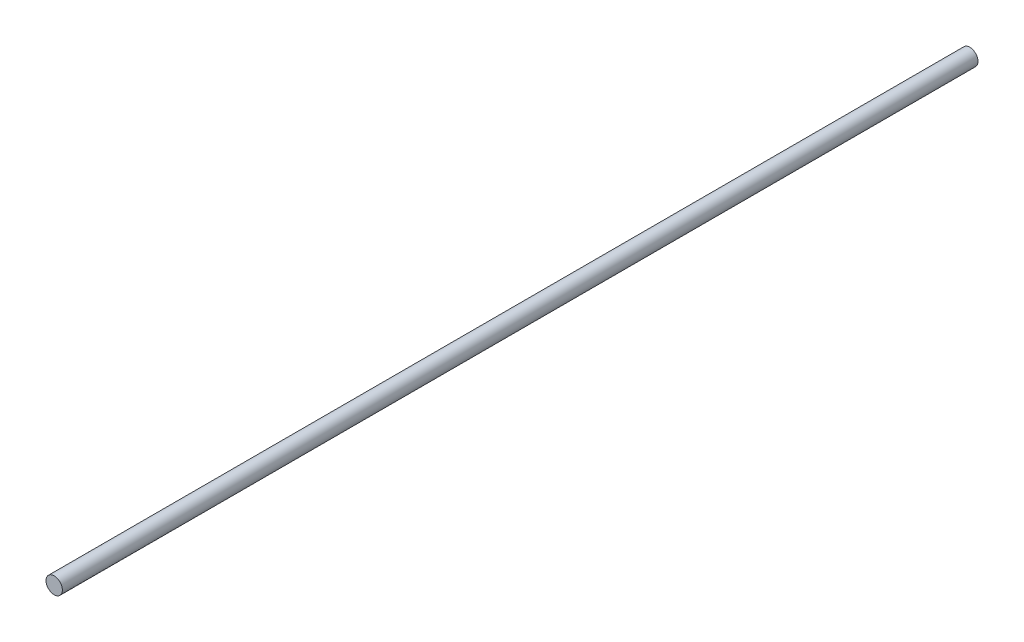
ISO-10303-21;
HEADER;
FILE_DESCRIPTION(('STEP AP214'),'2;1');
FILE_NAME('part.step','',(''),(''),'','','');
FILE_SCHEMA(('AUTOMOTIVE_DESIGN { 1 0 10303 214 1 1 1 1 }'));
ENDSEC;
DATA;
#1=APPLICATION_CONTEXT('core data for automotive mechanical design processes');
#2=APPLICATION_PROTOCOL_DEFINITION('international standard','automotive_design',2000,#1);
#3=PRODUCT_CONTEXT('',#1,'mechanical');
#4=PRODUCT('Part','Part','',(#3));
#5=PRODUCT_RELATED_PRODUCT_CATEGORY('part','',(#4));
#6=PRODUCT_DEFINITION_FORMATION('','',#4);
#7=PRODUCT_DEFINITION_CONTEXT('part definition',#1,'design');
#8=PRODUCT_DEFINITION('design','',#6,#7);
#9=PRODUCT_DEFINITION_SHAPE('','',#8);
#10=(LENGTH_UNIT() NAMED_UNIT(*) SI_UNIT(.MILLI.,.METRE.));
#11=(NAMED_UNIT(*) PLANE_ANGLE_UNIT() SI_UNIT($,.RADIAN.));
#12=(NAMED_UNIT(*) SI_UNIT($,.STERADIAN.) SOLID_ANGLE_UNIT());
#13=UNCERTAINTY_MEASURE_WITH_UNIT(LENGTH_MEASURE(1.E-05),#10,'distance_accuracy_value','');
#14=(GEOMETRIC_REPRESENTATION_CONTEXT(3) GLOBAL_UNCERTAINTY_ASSIGNED_CONTEXT((#13)) GLOBAL_UNIT_ASSIGNED_CONTEXT((#10,
#11,#12)) REPRESENTATION_CONTEXT('',''));
#15=CARTESIAN_POINT('',(0.,0.,0.));
#16=DIRECTION('',(0.,0.,1.));
#17=DIRECTION('',(1.,0.,0.));
#18=AXIS2_PLACEMENT_3D('',#15,#16,#17);
#19=CARTESIAN_POINT('',(0.,0.,-3350.));
#20=DIRECTION('',(0.,0.,1.));
#21=DIRECTION('',(1.,0.,0.));
#22=AXIS2_PLACEMENT_3D('',#19,#20,#21);
#23=CYLINDRICAL_SURFACE('',#22,30.);
#24=CARTESIAN_POINT('',(0.,0.,-3350.));
#25=DIRECTION('',(0.,0.,1.));
#26=DIRECTION('',(1.,0.,0.));
#27=AXIS2_PLACEMENT_3D('',#24,#25,#26);
#28=CIRCLE('',#27,30.);
#29=CARTESIAN_POINT('',(30.,0.,-3350.));
#30=VERTEX_POINT('',#29);
#31=EDGE_CURVE('E10',#30,#30,#28,.T.);
#32=CARTESIAN_POINT('',(0.,0.,0.));
#33=DIRECTION('',(0.,0.,1.));
#34=DIRECTION('',(1.,0.,0.));
#35=AXIS2_PLACEMENT_3D('',#32,#33,#34);
#36=CIRCLE('',#35,30.);
#37=CARTESIAN_POINT('',(30.,0.,0.));
#38=VERTEX_POINT('',#37);
#39=EDGE_CURVE('E40',#38,#38,#36,.T.);
#40=CARTESIAN_POINT('',(30.,0.,-3350.));
#41=CARTESIAN_POINT('',(30.,0.,-3315.10416666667));
#42=CARTESIAN_POINT('',(30.,0.,-3280.20833333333));
#43=CARTESIAN_POINT('',(30.,0.,-3210.41666666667));
#44=CARTESIAN_POINT('',(30.,0.,-3175.52083333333));
#45=CARTESIAN_POINT('',(30.,0.,-3105.72916666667));
#46=CARTESIAN_POINT('',(30.,0.,-3070.83333333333));
#47=CARTESIAN_POINT('',(30.,0.,-3001.04166666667));
#48=CARTESIAN_POINT('',(30.,0.,-2966.14583333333));
#49=CARTESIAN_POINT('',(30.,0.,-2896.35416666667));
#50=CARTESIAN_POINT('',(30.,0.,-2861.45833333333));
#51=CARTESIAN_POINT('',(30.,0.,-2791.66666666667));
#52=CARTESIAN_POINT('',(30.,0.,-2756.77083333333));
#53=CARTESIAN_POINT('',(30.,0.,-2686.97916666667));
#54=CARTESIAN_POINT('',(30.,0.,-2652.08333333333));
#55=CARTESIAN_POINT('',(30.,0.,-2582.29166666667));
#56=CARTESIAN_POINT('',(30.,0.,-2547.39583333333));
#57=CARTESIAN_POINT('',(30.,0.,-2477.60416666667));
#58=CARTESIAN_POINT('',(30.,0.,-2442.70833333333));
#59=CARTESIAN_POINT('',(30.,0.,-2372.91666666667));
#60=CARTESIAN_POINT('',(30.,0.,-2338.02083333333));
#61=CARTESIAN_POINT('',(30.,0.,-2268.22916666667));
#62=CARTESIAN_POINT('',(30.,0.,-2233.33333333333));
#63=CARTESIAN_POINT('',(30.,0.,-2163.54166666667));
#64=CARTESIAN_POINT('',(30.,0.,-2128.64583333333));
#65=CARTESIAN_POINT('',(30.,0.,-2058.85416666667));
#66=CARTESIAN_POINT('',(30.,0.,-2023.95833333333));
#67=CARTESIAN_POINT('',(30.,0.,-1954.16666666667));
#68=CARTESIAN_POINT('',(30.,0.,-1919.27083333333));
#69=CARTESIAN_POINT('',(30.,0.,-1849.47916666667));
#70=CARTESIAN_POINT('',(30.,0.,-1814.58333333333));
#71=CARTESIAN_POINT('',(30.,0.,-1744.79166666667));
#72=CARTESIAN_POINT('',(30.,0.,-1709.89583333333));
#73=CARTESIAN_POINT('',(30.,0.,-1640.10416666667));
#74=CARTESIAN_POINT('',(30.,0.,-1605.20833333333));
#75=CARTESIAN_POINT('',(30.,0.,-1535.41666666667));
#76=CARTESIAN_POINT('',(30.,0.,-1500.52083333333));
#77=CARTESIAN_POINT('',(30.,0.,-1430.72916666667));
#78=CARTESIAN_POINT('',(30.,0.,-1395.83333333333));
#79=CARTESIAN_POINT('',(30.,0.,-1326.04166666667));
#80=CARTESIAN_POINT('',(30.,0.,-1291.14583333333));
#81=CARTESIAN_POINT('',(30.,0.,-1221.35416666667));
#82=CARTESIAN_POINT('',(30.,0.,-1186.45833333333));
#83=CARTESIAN_POINT('',(30.,0.,-1116.66666666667));
#84=CARTESIAN_POINT('',(30.,0.,-1081.77083333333));
#85=CARTESIAN_POINT('',(30.,0.,-1011.97916666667));
#86=CARTESIAN_POINT('',(30.,0.,-977.083333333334));
#87=CARTESIAN_POINT('',(30.,0.,-907.291666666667));
#88=CARTESIAN_POINT('',(30.,0.,-872.395833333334));
#89=CARTESIAN_POINT('',(30.,0.,-802.604166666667));
#90=CARTESIAN_POINT('',(30.,0.,-767.708333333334));
#91=CARTESIAN_POINT('',(30.,0.,-697.916666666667));
#92=CARTESIAN_POINT('',(30.,0.,-663.020833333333));
#93=CARTESIAN_POINT('',(30.,0.,-593.229166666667));
#94=CARTESIAN_POINT('',(30.,0.,-558.333333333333));
#95=CARTESIAN_POINT('',(30.,0.,-488.541666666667));
#96=CARTESIAN_POINT('',(30.,0.,-453.645833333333));
#97=CARTESIAN_POINT('',(30.,0.,-383.854166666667));
#98=CARTESIAN_POINT('',(30.,0.,-348.958333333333));
#99=CARTESIAN_POINT('',(30.,0.,-279.166666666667));
#100=CARTESIAN_POINT('',(30.,0.,-244.270833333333));
#101=CARTESIAN_POINT('',(30.,0.,-174.479166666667));
#102=CARTESIAN_POINT('',(30.,0.,-139.583333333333));
#103=CARTESIAN_POINT('',(30.,0.,-69.7916666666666));
#104=CARTESIAN_POINT('',(30.,0.,-34.8958333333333));
#105=CARTESIAN_POINT('',(30.,0.,0.));
#106=B_SPLINE_CURVE_WITH_KNOTS('',3,(#40,#41,#42,#43,#44,#45,#46,#47,#48,#49,#50,#51,#52,#53,
#54,#55,#56,#57,#58,#59,#60,#61,#62,#63,#64,#65,#66,#67,#68,#69,#70,#71,#72,#73,#74,#75,#76,#77,
#78,#79,#80,#81,#82,#83,#84,#85,#86,#87,#88,#89,#90,#91,#92,#93,#94,#95,#96,#97,#98,#99,#100,
#101,#102,#103,#104,#105),.UNSPECIFIED.,.F.,.F.,(4,2,2,2,2,2,2,2,2,2,2,2,2,2,2,2,2,2,2,2,2,2,2,
2,2,2,2,2,2,2,2,2,4),(0.,104.6875,209.375,314.0625,418.75,523.4375,628.125,732.812500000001,
837.5,942.1875,1046.875,1151.5625,1256.25,1360.9375,1465.625,1570.3125,1675.,1779.6875,1884.375,
1989.0625,2093.75,2198.4375,2303.125,2407.8125,2512.5,2617.1875,2721.875,2826.5625,2931.25,
3035.9375,3140.625,3245.3125,3350.),.UNSPECIFIED.);
#107=EDGE_CURVE('BSEAM37',#30,#38,#106,.T.);
#108=ORIENTED_EDGE('',*,*,#31,.T.);
#109=ORIENTED_EDGE('',*,*,#39,.F.);
#110=ORIENTED_EDGE('',*,*,#107,.T.);
#111=ORIENTED_EDGE('',*,*,#107,.F.);
#112=EDGE_LOOP('',(#108,#110,#109,#111));
#113=FACE_BOUND('',#112,.T.);
#114=ADVANCED_FACE('F37',(#113),#23,.T.);
#115=CARTESIAN_POINT('',(0.,0.,-3350.));
#116=DIRECTION('',(0.,0.,1.));
#117=DIRECTION('',(1.,0.,0.));
#118=AXIS2_PLACEMENT_3D('',#115,#116,#117);
#119=PLANE('',#118);
#120=ORIENTED_EDGE('',*,*,#31,.F.);
#121=EDGE_LOOP('',(#120));
#122=FACE_BOUND('',#121,.T.);
#123=ADVANCED_FACE('F54',(#122),#119,.F.);
#124=CARTESIAN_POINT('',(0.,0.,0.));
#125=DIRECTION('',(0.,0.,1.));
#126=DIRECTION('',(1.,0.,0.));
#127=AXIS2_PLACEMENT_3D('',#124,#125,#126);
#128=PLANE('',#127);
#129=ORIENTED_EDGE('',*,*,#39,.T.);
#130=EDGE_LOOP('',(#129));
#131=FACE_BOUND('',#130,.T.);
#132=ADVANCED_FACE('F51',(#131),#128,.T.);
#133=CLOSED_SHELL('',(#114,#123,#132));
#134=MANIFOLD_SOLID_BREP('B2',#133);
#135=ADVANCED_BREP_SHAPE_REPRESENTATION('',(#18,#134),#14);
#136=SHAPE_DEFINITION_REPRESENTATION(#9,#135);
ENDSEC;
END-ISO-10303-21;
